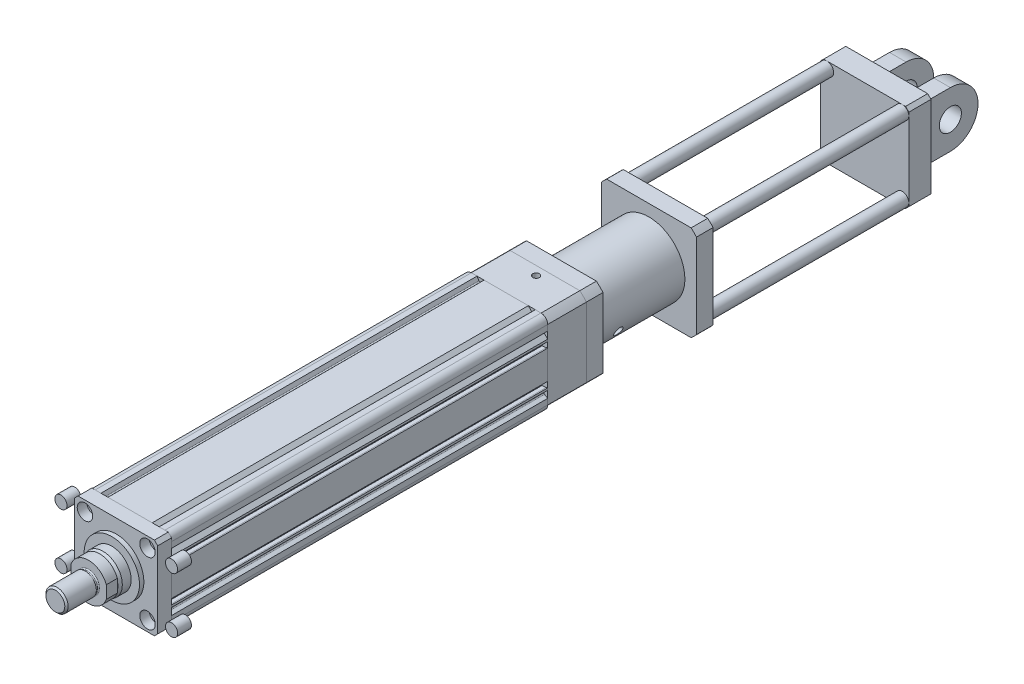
from build123d import *

# Parameters (mm, degrees)
SKETCH_1_R          = 31.5
SKETCH_1_R_2        = 3.35
EXTRUDE_1_DEPTH     = 340
SKETCH_2_R          = 5.5
EXTRUDE_1_2_DEPTH   = 12.5
EXTRUDE_1_2_2_DEPTH = 12.5
EXTRUDE_1_2_3_DEPTH = 12.5
EXTRUDE_1_2_4_DEPTH = 12.5
SKETCH_2_R_2        = 4.25
EXTRUDE_1_2_5_DEPTH = 12.5
SKETCH_3_R          = 7
SKETCH_3_R_2        = 4.25
CUT_EXTRUDE_1_DEPTH = 8.5
SKETCH_3_3_R        = 25
EXTRUDE_2_DEPTH     = 4
SKETCH_5_R          = 17.5
EXTRUDE_3_DEPTH     = 11
CHAMFER_1_SIZE      = 3
CHAMFER_1_SIZE2     = 1
EXTRUDE_4_DEPTH     = 10
SKETCH_8_R          = 9
EXTRUDE_5_DEPTH     = 3
SKETCH_9_R          = 10
EXTRUDE_6_DEPTH     = 27
CHAMFER_2_SIZE      = 1.5
FILLET_1_R          = 1
EXTRUDE_7_DEPTH     = 35
SKETCH_11_R         = 3
CUT_EXTRUDE_2_DEPTH = 5
EXTRUDE_8_DEPTH     = 15
SKETCH_13_R         = 32.5
EXTRUDE_9_DEPTH     = 79
SKETCH_14_R         = 3
EXTRUDE_10_DEPTH    = 15
SKETCH_15_R         = 40
CUT_EXTRUDE_3_DEPTH = 6
SKETCH_15_3_R       = 26
CUT_EXTRUDE_4_DEPTH = 101
SKETCH_16_R         = 4
CUT_EXTRUDE_5_DEPTH = 33
SKETCH_17_R         = 4
CUT_EXTRUDE_6_DEPTH = 33
SKETCH_19_R         = 40
EXTRUDE_11_DEPTH    = 1
EXTRUDE_START       = 180
SKETCH_20_W         = 80
SKETCH_20_H         = 80
EXTRUDE_12_DEPTH    = 20
SKETCH_21_R         = 6
EXTRUDE_13_DEPTH    = 180
EXTRUDE_13_2_DEPTH  = 180
EXTRUDE_13_3_DEPTH  = 180
EXTRUDE_13_4_DEPTH  = 180
SKETCH_22_R         = 3.006059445
SKETCH_22_R_2       = 4.25482181
SKETCH_22_R_3       = 3.757976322
SKETCH_22_R_4       = 3.612560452
EXTRUDE_14_DEPTH    = 15
SKETCH_23_W         = 15
SKETCH_23_H         = 50
EXTRUDE_15_DEPTH    = 55
SKETCH_24_R         = 10
CUT_EXTRUDE_7_DEPTH = 55
CHAMFER_3_SIZE      = 4
CHAMFER_4_SIZE      = 3


with BuildPart() as part:
    # Sketch 1 → Extrude 1 (new body)
    with BuildSketch(Plane.XY):
        with BuildLine():
            Line((-31.5, 37.5), (-26.33, 37.5))
            Line((-26.33, 37.5), (-24.66467188, 34.615567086))
            ThreePointArc((-24.66467188, 34.615567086), (-23.929172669, 34.124122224), (-23.091539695, 34.408460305))
            Line((-23.091539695, 34.408460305), (-20, 37.5))
            Line((-20, 37.5), (20, 37.5))
            Line((20, 37.5), (23.091539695, 34.408460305))
            ThreePointArc((23.091539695, 34.408460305), (23.929172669, 34.124122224), (24.66467188, 34.615567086))
            Line((24.66467188, 34.615567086), (26.33, 37.5))
            Line((26.33, 37.5), (31.5, 37.5))
            ThreePointArc((31.5, 37.5), (35.742640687, 35.742640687), (37.5, 31.5))
            Line((37.5, 31.5), (37.5, 26.33))
            Line((37.5, 26.33), (34.615567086, 24.66467188))
            ThreePointArc((34.615567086, 24.66467188), (34.124122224, 23.929172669), (34.408460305, 23.091539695))
            Line((34.408460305, 23.091539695), (37.5, 20))
            Line((37.5, 20), (37.5, 18.1))
            Line((37.5, 18.1), (36.5, 18.1))
            Line((36.5, 18.1), (36.5, 18.7))
            Line((36.5, 18.7), (32.5, 18.7))
            Line((32.5, 18.7), (32.5, 12.4))
            Line((32.5, 12.4), (36.5, 12.4))
            Line((36.5, 12.4), (36.5, 13))
            Line((36.5, 13), (37.5, 13))
            Line((37.5, 13), (37.5, -13))
            Line((37.5, -13), (36.5, -13))
            Line((36.5, -13), (36.5, -12.4))
            Line((36.5, -12.4), (32.5, -12.4))
            Line((32.5, -12.4), (32.5, -18.7))
            Line((32.5, -18.7), (36.5, -18.7))
            Line((36.5, -18.7), (36.5, -18.1))
            Line((36.5, -18.1), (37.5, -18.1))
            Line((37.5, -18.1), (37.5, -20))
            Line((37.5, -20), (34.408460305, -23.091539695))
            ThreePointArc((34.408460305, -23.091539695), (34.124122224, -23.929172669), (34.615567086, -24.66467188))
            Line((34.615567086, -24.66467188), (37.5, -26.33))
            Line((37.5, -26.33), (37.5, -31.5))
            ThreePointArc((37.5, -31.5), (35.742640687, -35.742640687), (31.5, -37.5))
            Line((31.5, -37.5), (26.33, -37.5))
            Line((26.33, -37.5), (24.66467188, -34.615567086))
            ThreePointArc((24.66467188, -34.615567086), (23.929172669, -34.124122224), (23.091539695, -34.408460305))
            Line((23.091539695, -34.408460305), (20, -37.5))
            Line((20, -37.5), (18.1, -37.5))
            Line((18.1, -37.5), (18.1, -36.5))
            Line((18.1, -36.5), (18.7, -36.5))
            Line((18.7, -36.5), (18.7, -33.945032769))
            Line((18.7, -33.945032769), (12.4, -33.945032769))
            Line((12.4, -33.945032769), (12.4, -36.5))
            Line((12.4, -36.5), (13, -36.5))
            Line((13, -36.5), (13, -37.5))
            Line((13, -37.5), (-13, -37.5))
            Line((-13, -37.5), (-13, -36.5))
            Line((-13, -36.5), (-12.4, -36.5))
            Line((-12.4, -36.5), (-12.4, -33.945032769))
            Line((-12.4, -33.945032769), (-18.7, -33.945032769))
            Line((-18.7, -33.945032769), (-18.7, -36.5))
            Line((-18.7, -36.5), (-18.1, -36.5))
            Line((-18.1, -36.5), (-18.1, -37.5))
            Line((-18.1, -37.5), (-20, -37.5))
            Line((-20, -37.5), (-23.091539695, -34.408460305))
            ThreePointArc((-23.091539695, -34.408460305), (-23.929172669, -34.124122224), (-24.66467188, -34.615567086))
            Line((-24.66467188, -34.615567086), (-26.33, -37.5))
            Line((-26.33, -37.5), (-31.5, -37.5))
            ThreePointArc((-31.5, -37.5), (-35.742640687, -35.742640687), (-37.5, -31.5))
            Line((-37.5, -31.5), (-37.5, -26.33))
            Line((-37.5, -26.33), (-34.615567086, -24.66467188))
            ThreePointArc((-34.615567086, -24.66467188), (-34.124122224, -23.929172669), (-34.408460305, -23.091539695))
            Line((-34.408460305, -23.091539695), (-37.5, -20))
            Line((-37.5, -20), (-37.5, -18.1))
            Line((-37.5, -18.1), (-36.5, -18.1))
            Line((-36.5, -18.1), (-36.5, -18.7))
            Line((-36.5, -18.7), (-32.5, -18.7))
            Line((-32.5, -18.7), (-32.5, -12.4))
            Line((-32.5, -12.4), (-36.5, -12.4))
            Line((-36.5, -12.4), (-36.5, -13))
            Line((-36.5, -13), (-37.5, -13))
            Line((-37.5, -13), (-37.5, 13))
            Line((-37.5, 13), (-36.5, 13))
            Line((-36.5, 13), (-36.5, 12.4))
            Line((-36.5, 12.4), (-32.5, 12.4))
            Line((-32.5, 12.4), (-32.5, 18.7))
            Line((-32.5, 18.7), (-36.5, 18.7))
            Line((-36.5, 18.7), (-36.5, 18.1))
            Line((-36.5, 18.1), (-37.5, 18.1))
            Line((-37.5, 18.1), (-37.5, 20))
            Line((-37.5, 20), (-34.408460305, 23.091539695))
            ThreePointArc((-34.408460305, 23.091539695), (-34.124122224, 23.929172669), (-34.615567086, 24.66467188))
            Line((-34.615567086, 24.66467188), (-37.5, 26.33))
            Line((-37.5, 26.33), (-37.5, 31.5))
            ThreePointArc((-37.5, 31.5), (-35.742640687, 35.742640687), (-31.5, 37.5))
        make_face()
        Circle(SKETCH_1_R, mode=Mode.SUBTRACT)
        with Locations((-28.25, 28.25)):
            Circle(SKETCH_1_R_2, mode=Mode.SUBTRACT)
        with Locations(Location((28.25, 28.25, 0), (0, 0, 180))):
            Circle(SKETCH_1_R_2, mode=Mode.SUBTRACT)
        with Locations((28.25, -28.25)):
            Circle(SKETCH_1_R_2, mode=Mode.SUBTRACT)
        with Locations(Location((-28.25, -28.25, 0), (0, 0, 180))):
            Circle(SKETCH_1_R_2, mode=Mode.SUBTRACT)
    extrude(amount=EXTRUDE_1_DEPTH)


with BuildPart() as body_2:
    # Sketch 2 → Extrude 1 2 (new body)
    with BuildSketch(Plane.XY.offset(340)):
        with Locations((-50, 25)):
            Circle(SKETCH_2_R)
    extrude(amount=EXTRUDE_1_2_DEPTH)


with BuildPart() as body_3:
    # Sketch 2 → Extrude 1 2 2 (new body)
    with BuildSketch(Plane.XY.offset(340)):
        with Locations(Location((50, 25, 0), (0, 0, 180))):
            Circle(SKETCH_2_R)
    extrude(amount=EXTRUDE_1_2_2_DEPTH)


with BuildPart() as body_4:
    # Sketch 2 → Extrude 1 2 3 (new body)
    with BuildSketch(Plane.XY.offset(340)):
        with Locations(Location((-50, -25, 0), (0, 0, 180))):
            Circle(SKETCH_2_R)
    extrude(amount=EXTRUDE_1_2_3_DEPTH)


with BuildPart() as body_5:
    # Sketch 2 → Extrude 1 2 4 (new body)
    with BuildSketch(Plane.XY.offset(340)):
        with Locations((50, -25)):
            Circle(SKETCH_2_R)
    extrude(amount=EXTRUDE_1_2_4_DEPTH)


with BuildPart() as body_6:
    # Sketch 2 → Extrude 1 2 5 (new body)
    with BuildSketch(Plane.XY.offset(340)):
        Polygon((-37.5, 34.5), (-34.5, 37.5), (34.5, 37.5), (37.5, 34.5), (37.5, -34.5), (34.5, -37.5), (-34.5, -37.5), (-37.5, -34.5), align=None)
        with Locations((-28.25, 28.25)):
            Circle(SKETCH_2_R_2, mode=Mode.SUBTRACT)
        with Locations(Location((28.25, 28.25, 0), (0, 0, 180))):
            Circle(SKETCH_2_R_2, mode=Mode.SUBTRACT)
        with Locations(Location((-28.25, -28.25, 0), (0, 0, 180))):
            Circle(SKETCH_2_R_2, mode=Mode.SUBTRACT)
        with Locations((28.25, -28.25)):
            Circle(SKETCH_2_R_2, mode=Mode.SUBTRACT)
    extrude(amount=EXTRUDE_1_2_5_DEPTH)

    # Sketch 3 → Cut-Extrude 1 (cut)
    # profile 1 of 4: a face of its own
    with BuildSketch(Plane.XY.offset(352.5)):
        with Locations((28.25, -28.25)):
            Circle(SKETCH_3_R)
        with Locations((28.25, -28.25)):
            Circle(SKETCH_3_R_2, mode=Mode.SUBTRACT)
    # profile 2 of 4: a face of its own
    with BuildSketch(Plane.XY.offset(352.5)):
        with Locations((-28.25, -28.25)):
            Circle(SKETCH_3_R)
        with Locations(Location((-28.25, -28.25, 0), (0, 0, 180))):
            Circle(SKETCH_3_R_2, mode=Mode.SUBTRACT)
    # profile 3 of 4: a face of its own
    with BuildSketch(Plane.XY.offset(352.5)):
        with Locations((-28.25, 28.25)):
            Circle(SKETCH_3_R)
    # profile 4 of 4: a face of its own
    with BuildSketch(Plane.XY.offset(352.5)):
        with Locations((28.25, 28.25)):
            Circle(SKETCH_3_R)
    extrude(amount=-CUT_EXTRUDE_1_DEPTH, mode=Mode.SUBTRACT)

    # Sketch 3_3 → Extrude 2 (add)
    with BuildSketch(Plane.XY.offset(352.5)):
        Circle(SKETCH_3_3_R)
    extrude(amount=EXTRUDE_2_DEPTH)

    # Sketch 5 → Extrude 3 (add)
    with BuildSketch(Plane.XY.offset(356.5)):
        Circle(SKETCH_5_R)
    extrude(amount=EXTRUDE_3_DEPTH)

    # Chamfer 1
    chamfer_1_edges = [body_6.edges().sort_by_distance(p)[0] for p in [
        (-17.5, 0, 367.5),
    ]]
    chamfer_1_side = [body_6.faces().sort_by_distance(p)[0] for p in [
        (-17.5, 0, 362),
    ]]
    chamfer(chamfer_1_edges, length=CHAMFER_1_SIZE, length2=CHAMFER_1_SIZE2, reference=chamfer_1_side[0])

    # Sketch 6 → Extrude 4 (add)
    with BuildSketch(Plane.XY.offset(367.5)):
        with BuildLine():
            Line((-16, 5.744562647), (-16, -5.744562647))
            ThreePointArc((-16, -5.744562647), (0, -17), (16, -5.744562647))
            Line((16, -5.744562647), (16, 5.744562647))
            ThreePointArc((16, 5.744562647), (0, 17), (-16, 5.744562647))
        make_face()
    extrude(amount=EXTRUDE_4_DEPTH)

    # Sketch 8 → Extrude 5 (add)
    with BuildSketch(Plane.XY.offset(377.5)):
        Circle(SKETCH_8_R)
    extrude(amount=EXTRUDE_5_DEPTH)

    # Sketch 9 → Extrude 6 (add)
    with BuildSketch(Plane.XY.offset(380.5)):
        Circle(SKETCH_9_R)
    extrude(amount=EXTRUDE_6_DEPTH)

    # Chamfer 2
    chamfer_2_edges = [body_6.edges().sort_by_distance(p)[0] for p in [
        (-10, 0, 407.5),
    ]]
    chamfer(chamfer_2_edges, length=CHAMFER_2_SIZE)

    # Fillet 1
    fillet_1_edges = [body_6.edges().sort_by_distance(p)[0] for p in [
        (-9, 0, 377.5),
    ]]
    fillet(fillet_1_edges, radius=FILLET_1_R)


with BuildPart() as body_7:
    # Sketch 10 → Extrude 7 (new body)
    with BuildSketch(Plane(origin=(0, 0, 0), x_dir=(-1, 0, 0), z_dir=(0, 0, -1))):
        with BuildLine():
            Line((-31.539657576, 37.5), (31.539657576, 37.5))
            ThreePointArc((31.539657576, 37.5), (34.648232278, 34.648232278), (37.5, 31.539657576))
            Line((37.5, 31.539657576), (37.5, -31.539657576))
            ThreePointArc((37.5, -31.539657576), (34.648232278, -34.648232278), (31.539657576, -37.5))
            Line((31.539657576, -37.5), (-31.539657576, -37.5))
            ThreePointArc((-31.539657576, -37.5), (-34.648232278, -34.648232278), (-37.5, -31.539657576))
            Line((-37.5, -31.539657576), (-37.5, 31.539657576))
            ThreePointArc((-37.5, 31.539657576), (-34.648232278, 34.648232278), (-31.539657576, 37.5))
        make_face()
    extrude(amount=EXTRUDE_7_DEPTH)

    # Sketch 11 → Cut-Extrude 2 (cut)
    with BuildSketch(Plane(origin=(0, 37.5, 0), x_dir=(1, 0, 0), z_dir=(0, 1, 0))):
        with Locations(Location((0, 27, 0), (0, 0, 270))):
            Circle(SKETCH_11_R)
    extrude(amount=-CUT_EXTRUDE_2_DEPTH, mode=Mode.SUBTRACT)


with BuildPart() as body_8:
    # Sketch 12 → Extrude 8 (new body)
    with BuildSketch(Plane(origin=(0, 0, -35), x_dir=(-1, 0, 0), z_dir=(0, 0, -1))):
        with BuildLine():
            Line((-31.539657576, 37.5), (31.539657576, 37.5))
            ThreePointArc((31.539657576, 37.5), (34.648232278, 34.648232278), (37.5, 31.539657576))
            Line((37.5, 31.539657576), (37.5, -31.539657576))
            ThreePointArc((37.5, -31.539657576), (34.648232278, -34.648232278), (31.539657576, -37.5))
            Line((31.539657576, -37.5), (-31.539657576, -37.5))
            ThreePointArc((-31.539657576, -37.5), (-34.648232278, -34.648232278), (-37.5, -31.539657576))
            Line((-37.5, -31.539657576), (-37.5, 31.539657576))
            ThreePointArc((-37.5, 31.539657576), (-34.648232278, 34.648232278), (-31.539657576, 37.5))
        make_face()
    extrude(amount=EXTRUDE_8_DEPTH)

    # Sketch 13 → Extrude 9 (add)
    with BuildSketch(Plane(origin=(0, 0, -50), x_dir=(-1, 0, 0), z_dir=(0, 0, -1))):
        Circle(SKETCH_13_R)
    extrude(amount=EXTRUDE_9_DEPTH)

    # Sketch 14 → Extrude 10 (add)
    with BuildSketch(Plane(origin=(0, 0, -129), x_dir=(-1, 0, 0), z_dir=(0, 0, -1))):
        with BuildLine():
            Line((-38.173943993, 43), (38.173943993, 43))
            ThreePointArc((38.173943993, 43), (40.658639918, 40.658639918), (43, 38.173943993))
            Line((43, 38.173943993), (43, -38.173943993))
            ThreePointArc((43, -38.173943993), (40.658639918, -40.658639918), (38.173943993, -43))
            Line((38.173943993, -43), (-38.173943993, -43))
            ThreePointArc((-38.173943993, -43), (-40.658639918, -40.658639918), (-43, -38.173943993))
            Line((-43, -38.173943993), (-43, 38.173943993))
            ThreePointArc((-43, 38.173943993), (-40.658639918, 40.658639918), (-38.173943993, 43))
        make_face()
        with Locations((-35.355339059, 35.355339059)):
            Circle(SKETCH_14_R, mode=Mode.SUBTRACT)
        with Locations((35.355339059, 35.355339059)):
            Circle(SKETCH_14_R, mode=Mode.SUBTRACT)
        with Locations((35.355339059, -35.355339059)):
            Circle(SKETCH_14_R, mode=Mode.SUBTRACT)
        with Locations((-35.355339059, -35.355339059)):
            Circle(SKETCH_14_R, mode=Mode.SUBTRACT)
    extrude(amount=EXTRUDE_10_DEPTH)

    # Sketch 15 → Cut-Extrude 3 (cut)
    with BuildSketch(Plane(origin=(0, 0, -144), x_dir=(-1, 0, 0), z_dir=(0, 0, -1))):
        Circle(SKETCH_15_R)
    extrude(amount=-CUT_EXTRUDE_3_DEPTH, mode=Mode.SUBTRACT)

    # Sketch 15_3 → Cut-Extrude 4 (cut)
    with BuildSketch(Plane(origin=(0, 0, -144), x_dir=(-1, 0, 0), z_dir=(0, 0, -1))):
        Circle(SKETCH_15_3_R)
    extrude(amount=-CUT_EXTRUDE_4_DEPTH, mode=Mode.SUBTRACT)

    # Sketch 16 → Cut-Extrude 5 (cut)
    with BuildSketch(Plane.ZY.offset(43)):
        with Locations(Location((-114.809213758, 18.123645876, 0), (0, 0, 270))):
            Circle(SKETCH_16_R)
    extrude(amount=-CUT_EXTRUDE_5_DEPTH, mode=Mode.SUBTRACT)

    # Sketch 17 → Cut-Extrude 6 (cut)
    with BuildSketch(Plane(origin=(37.5, 0, 0), x_dir=(0, 0, -1), z_dir=(1, 0, 0))):
        with Locations((72.17264024, -14.20893096)):
            Circle(SKETCH_17_R)
    extrude(amount=-CUT_EXTRUDE_6_DEPTH, mode=Mode.SUBTRACT)

    # Sketch 19 → Extrude 11 (add)
    with BuildSketch(Plane(origin=(0, 0, -144), x_dir=(-1, 0, 0), z_dir=(0, 0, -1))):
        Circle(SKETCH_19_R)
    extrude(amount=-EXTRUDE_11_DEPTH)



with BuildPart() as body_9:
    # Sketch 20 → Extrude 12 (new body)
    with BuildSketch(Plane(origin=(0, 0, -144), x_dir=(-1, 0, 0), z_dir=(0, 0, -1)).offset(EXTRUDE_START)):
        Rectangle(SKETCH_20_W, SKETCH_20_H)
    extrude(amount=EXTRUDE_12_DEPTH)

    # Sketch 23 → Extrude 15 (add)
    with BuildSketch(Plane(origin=(0, 0, -344), x_dir=(-1, 0, 0), z_dir=(0, 0, -1))):
        with Locations((-20, 0)):
            Rectangle(SKETCH_23_W, SKETCH_23_H)
        with Locations((20, 0)):
            Rectangle(SKETCH_23_W, SKETCH_23_H)
    extrude(amount=EXTRUDE_15_DEPTH)

    # Sketch 24 → Cut-Extrude 7 (cut)
    with BuildSketch(Plane.ZY.offset(27.5)):
        with Locations(Location((-374, 0, 0), (0, 0, 270))):
            Circle(SKETCH_24_R)
        with BuildLine():
            Line((-374, 25), (-420.639644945, 44.829432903))
            Line((-420.639644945, 44.829432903), (-411.308017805, -29.512529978))
            Line((-411.308017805, -29.512529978), (-386.423678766, -54.707923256))
            Line((-386.423678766, -54.707923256), (-374, -25))
            ThreePointArc((-374, -25), (-399, 0), (-374, 25))
        make_face()
    extrude(amount=-CUT_EXTRUDE_7_DEPTH, mode=Mode.SUBTRACT)

    # Chamfer 3
    chamfer_3_edges = [body_9.edges().sort_by_distance(p)[0] for p in [
        (12.5, 0, -344),
        (20, 25, -344),
        (27.5, 0, -344),
        (20, -25, -344),
        (-27.5, 0, -344),
        (-20, 25, -344),
        (-12.5, 0, -344),
        (-20, -25, -344),
    ]]
    chamfer(chamfer_3_edges, length=CHAMFER_3_SIZE)

    # Chamfer 4
    chamfer_4_edges = [body_9.edges().sort_by_distance(p)[0] for p in [
        (-40, -40, -334),
        (40, -40, -334),
        (40, 40, -334),
        (-40, 40, -334),
    ]]
    chamfer(chamfer_4_edges, length=CHAMFER_4_SIZE)


with BuildPart() as body_10:
    # Sketch 21 → Extrude 13 (new body)
    with BuildSketch(Plane(origin=(0, 0, -144), x_dir=(-1, 0, 0), z_dir=(0, 0, -1))):
        with Locations(Location((-34, 34, 0), (0, 0, 180))):
            Circle(SKETCH_21_R)
    extrude(amount=EXTRUDE_13_DEPTH)


with BuildPart() as body_11:
    # Sketch 21 → Extrude 13 2 (new body)
    with BuildSketch(Plane(origin=(0, 0, -144), x_dir=(-1, 0, 0), z_dir=(0, 0, -1))):
        with Locations(Location((34, 34, 0), (0, 0, 180))):
            Circle(SKETCH_21_R)
    extrude(amount=EXTRUDE_13_2_DEPTH)


with BuildPart() as body_12:
    # Sketch 21 → Extrude 13 3 (new body)
    with BuildSketch(Plane(origin=(0, 0, -144), x_dir=(-1, 0, 0), z_dir=(0, 0, -1))):
        with Locations(Location((34, -34, 0), (0, 0, 180))):
            Circle(SKETCH_21_R)
    extrude(amount=EXTRUDE_13_3_DEPTH)


with BuildPart() as body_13:
    # Sketch 21 → Extrude 13 4 (new body)
    with BuildSketch(Plane(origin=(0, 0, -144), x_dir=(-1, 0, 0), z_dir=(0, 0, -1))):
        with Locations(Location((-34, -34, 0), (0, 0, 180))):
            Circle(SKETCH_21_R)
    extrude(amount=EXTRUDE_13_4_DEPTH)


with BuildPart() as body_8_1:
    add(body_8.part)

    add(body_10.part)  # Extrude 14 merges body 10

    add(body_11.part)  # Extrude 14 merges body 11

    add(body_12.part)  # Extrude 14 merges body 12

    add(body_13.part)  # Extrude 14 merges body 13
    # Sketch 22 → Extrude 14 (add)
    with BuildSketch(Plane.XY.offset(-129)):
        with Locations((-35.355339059, 35.355339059)):
            Circle(SKETCH_22_R)
        with Locations((35.820565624, 35.355339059)):
            Circle(SKETCH_22_R_2)
        with Locations((-35.355339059, -35.355339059)):
            Circle(SKETCH_22_R_3)
        with Locations((35.355339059, -35.355339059)):
            Circle(SKETCH_22_R_4)
    extrude(amount=-EXTRUDE_14_DEPTH)


solid = Compound([part.part, body_2.part, body_3.part, body_4.part, body_5.part, body_6.part, body_7.part, body_9.part, body_8_1.part])
